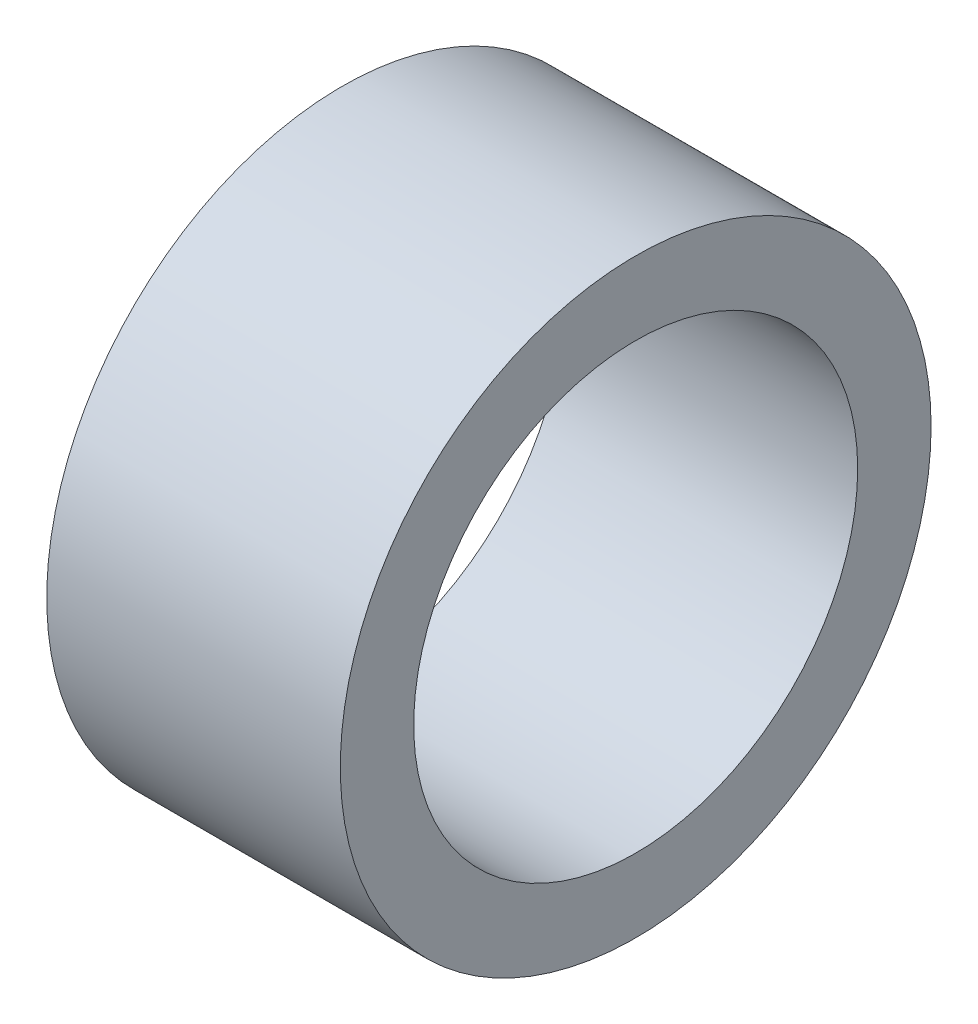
ISO-10303-21;
HEADER;
FILE_DESCRIPTION(('STEP AP214'),'2;1');
FILE_NAME('part.step','',(''),(''),'','','');
FILE_SCHEMA(('AUTOMOTIVE_DESIGN { 1 0 10303 214 1 1 1 1 }'));
ENDSEC;
DATA;
#1=APPLICATION_CONTEXT('core data for automotive mechanical design processes');
#2=APPLICATION_PROTOCOL_DEFINITION('international standard','automotive_design',2000,#1);
#3=PRODUCT_CONTEXT('',#1,'mechanical');
#4=PRODUCT('Part','Part','',(#3));
#5=PRODUCT_RELATED_PRODUCT_CATEGORY('part','',(#4));
#6=PRODUCT_DEFINITION_FORMATION('','',#4);
#7=PRODUCT_DEFINITION_CONTEXT('part definition',#1,'design');
#8=PRODUCT_DEFINITION('design','',#6,#7);
#9=PRODUCT_DEFINITION_SHAPE('','',#8);
#10=(LENGTH_UNIT() NAMED_UNIT(*) SI_UNIT(.MILLI.,.METRE.));
#11=(NAMED_UNIT(*) PLANE_ANGLE_UNIT() SI_UNIT($,.RADIAN.));
#12=(NAMED_UNIT(*) SI_UNIT($,.STERADIAN.) SOLID_ANGLE_UNIT());
#13=UNCERTAINTY_MEASURE_WITH_UNIT(LENGTH_MEASURE(1.E-05),#10,'distance_accuracy_value','');
#14=(GEOMETRIC_REPRESENTATION_CONTEXT(3) GLOBAL_UNCERTAINTY_ASSIGNED_CONTEXT((#13)) GLOBAL_UNIT_ASSIGNED_CONTEXT((#10,
#11,#12)) REPRESENTATION_CONTEXT('',''));
#15=CARTESIAN_POINT('',(0.,0.,0.));
#16=DIRECTION('',(0.,0.,1.));
#17=DIRECTION('',(1.,0.,0.));
#18=AXIS2_PLACEMENT_3D('',#15,#16,#17);
#19=CARTESIAN_POINT('',(4.,0.,0.));
#20=DIRECTION('',(1.,0.,0.));
#21=DIRECTION('',(0.,0.,-1.));
#22=AXIS2_PLACEMENT_3D('',#19,#20,#21);
#23=PLANE('',#22);
#24=CARTESIAN_POINT('',(4.,0.,0.));
#25=DIRECTION('',(1.,0.,0.));
#26=DIRECTION('',(0.,0.,-1.));
#27=AXIS2_PLACEMENT_3D('',#24,#25,#26);
#28=CIRCLE('',#27,4.025);
#29=CARTESIAN_POINT('',(4.,0.,-4.025));
#30=VERTEX_POINT('',#29);
#31=EDGE_CURVE('E10',#30,#30,#28,.T.);
#32=ORIENTED_EDGE('',*,*,#31,.T.);
#33=EDGE_LOOP('',(#32));
#34=FACE_BOUND('',#33,.T.);
#35=CARTESIAN_POINT('',(4.,0.,0.));
#36=DIRECTION('',(1.,0.,0.));
#37=DIRECTION('',(0.,0.,-1.));
#38=AXIS2_PLACEMENT_3D('',#35,#36,#37);
#39=CIRCLE('',#38,3.025);
#40=CARTESIAN_POINT('',(4.,0.,-3.025));
#41=VERTEX_POINT('',#40);
#42=EDGE_CURVE('E44',#41,#41,#39,.T.);
#43=ORIENTED_EDGE('',*,*,#42,.F.);
#44=EDGE_LOOP('',(#43));
#45=FACE_BOUND('',#44,.T.);
#46=ADVANCED_FACE('F33',(#34,#45),#23,.T.);
#47=CARTESIAN_POINT('',(0.,0.,0.));
#48=DIRECTION('',(1.,0.,0.));
#49=DIRECTION('',(0.,0.,-1.));
#50=AXIS2_PLACEMENT_3D('',#47,#48,#49);
#51=PLANE('',#50);
#52=CARTESIAN_POINT('',(0.,0.,0.));
#53=DIRECTION('',(1.,0.,0.));
#54=DIRECTION('',(0.,0.,-1.));
#55=AXIS2_PLACEMENT_3D('',#52,#53,#54);
#56=CIRCLE('',#55,4.025);
#57=CARTESIAN_POINT('',(0.,0.,-4.025));
#58=VERTEX_POINT('',#57);
#59=EDGE_CURVE('E37',#58,#58,#56,.T.);
#60=ORIENTED_EDGE('',*,*,#59,.F.);
#61=EDGE_LOOP('',(#60));
#62=FACE_BOUND('',#61,.T.);
#63=CARTESIAN_POINT('',(0.,0.,0.));
#64=DIRECTION('',(1.,0.,0.));
#65=DIRECTION('',(0.,0.,-1.));
#66=AXIS2_PLACEMENT_3D('',#63,#64,#65);
#67=CIRCLE('',#66,3.025);
#68=CARTESIAN_POINT('',(0.,0.,-3.025));
#69=VERTEX_POINT('',#68);
#70=EDGE_CURVE('E46',#69,#69,#67,.T.);
#71=ORIENTED_EDGE('',*,*,#70,.T.);
#72=EDGE_LOOP('',(#71));
#73=FACE_BOUND('',#72,.T.);
#74=ADVANCED_FACE('F56',(#62,#73),#51,.F.);
#75=CARTESIAN_POINT('',(4.,0.,0.));
#76=DIRECTION('',(-1.,0.,0.));
#77=DIRECTION('',(0.,0.,1.));
#78=AXIS2_PLACEMENT_3D('',#75,#76,#77);
#79=CYLINDRICAL_SURFACE('',#78,4.025);
#80=ORIENTED_EDGE('',*,*,#31,.F.);
#81=EDGE_LOOP('',(#80));
#82=FACE_BOUND('',#81,.T.);
#83=ORIENTED_EDGE('',*,*,#59,.T.);
#84=EDGE_LOOP('',(#83));
#85=FACE_BOUND('',#84,.T.);
#86=ADVANCED_FACE('F35',(#82,#85),#79,.T.);
#87=CARTESIAN_POINT('',(4.,0.,0.));
#88=DIRECTION('',(-1.,0.,0.));
#89=DIRECTION('',(0.,0.,1.));
#90=AXIS2_PLACEMENT_3D('',#87,#88,#89);
#91=CYLINDRICAL_SURFACE('',#90,3.025);
#92=ORIENTED_EDGE('',*,*,#42,.T.);
#93=EDGE_LOOP('',(#92));
#94=FACE_BOUND('',#93,.T.);
#95=ORIENTED_EDGE('',*,*,#70,.F.);
#96=EDGE_LOOP('',(#95));
#97=FACE_BOUND('',#96,.T.);
#98=ADVANCED_FACE('F52',(#94,#97),#91,.F.);
#99=CLOSED_SHELL('',(#46,#74,#86,#98));
#100=MANIFOLD_SOLID_BREP('B2',#99);
#101=ADVANCED_BREP_SHAPE_REPRESENTATION('',(#18,#100),#14);
#102=SHAPE_DEFINITION_REPRESENTATION(#9,#101);
ENDSEC;
END-ISO-10303-21;
